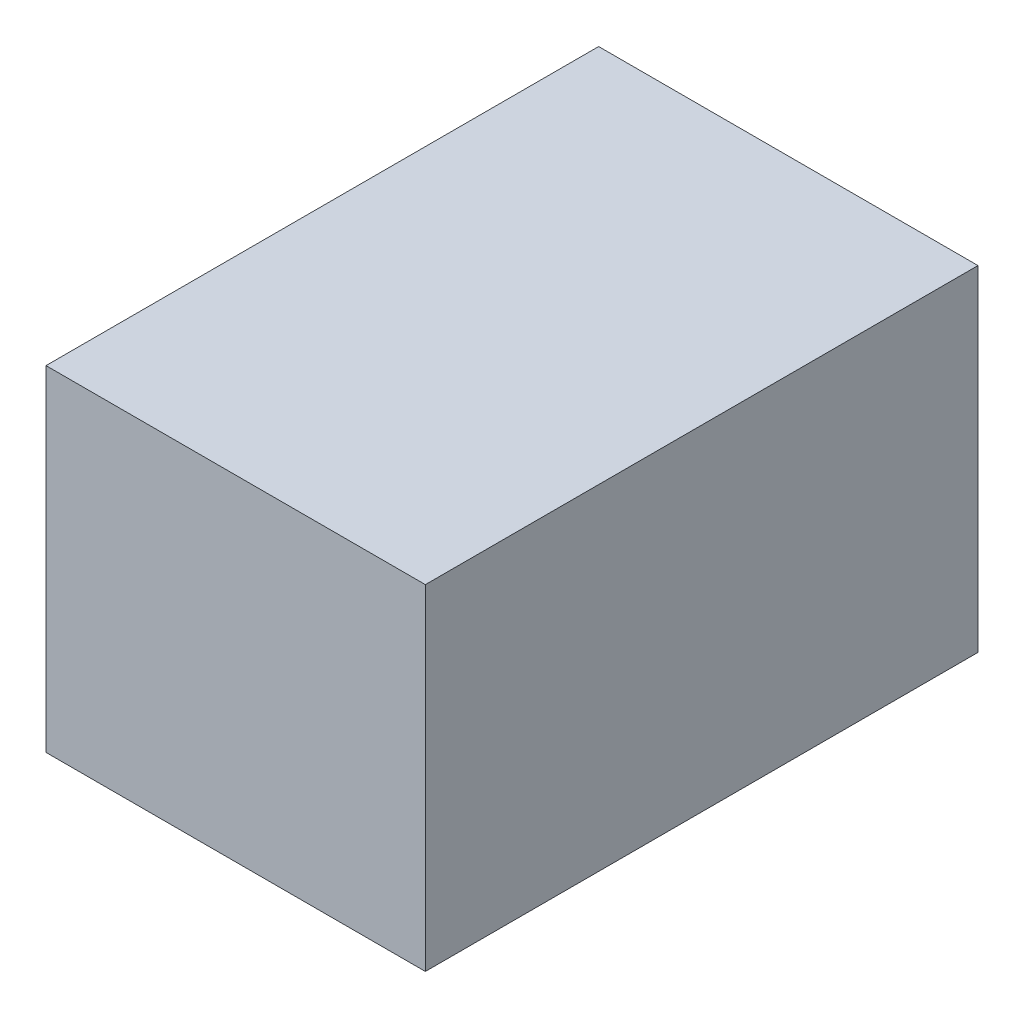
ISO-10303-21;
HEADER;
FILE_DESCRIPTION(('STEP AP214'),'2;1');
FILE_NAME('part.step','',(''),(''),'','','');
FILE_SCHEMA(('AUTOMOTIVE_DESIGN { 1 0 10303 214 1 1 1 1 }'));
ENDSEC;
DATA;
#1=APPLICATION_CONTEXT('core data for automotive mechanical design processes');
#2=APPLICATION_PROTOCOL_DEFINITION('international standard','automotive_design',2000,#1);
#3=PRODUCT_CONTEXT('',#1,'mechanical');
#4=PRODUCT('Part','Part','',(#3));
#5=PRODUCT_RELATED_PRODUCT_CATEGORY('part','',(#4));
#6=PRODUCT_DEFINITION_FORMATION('','',#4);
#7=PRODUCT_DEFINITION_CONTEXT('part definition',#1,'design');
#8=PRODUCT_DEFINITION('design','',#6,#7);
#9=PRODUCT_DEFINITION_SHAPE('','',#8);
#10=(LENGTH_UNIT() NAMED_UNIT(*) SI_UNIT(.MILLI.,.METRE.));
#11=(NAMED_UNIT(*) PLANE_ANGLE_UNIT() SI_UNIT($,.RADIAN.));
#12=(NAMED_UNIT(*) SI_UNIT($,.STERADIAN.) SOLID_ANGLE_UNIT());
#13=UNCERTAINTY_MEASURE_WITH_UNIT(LENGTH_MEASURE(1.E-05),#10,'distance_accuracy_value','');
#14=(GEOMETRIC_REPRESENTATION_CONTEXT(3) GLOBAL_UNCERTAINTY_ASSIGNED_CONTEXT((#13)) GLOBAL_UNIT_ASSIGNED_CONTEXT((#10,
#11,#12)) REPRESENTATION_CONTEXT('',''));
#15=CARTESIAN_POINT('',(0.,0.,0.));
#16=DIRECTION('',(0.,0.,1.));
#17=DIRECTION('',(1.,0.,0.));
#18=AXIS2_PLACEMENT_3D('',#15,#16,#17);
#19=CARTESIAN_POINT('',(102.966766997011,90.934066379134,300.));
#20=DIRECTION('',(-1.,0.,0.));
#21=DIRECTION('',(0.,0.,1.));
#22=AXIS2_PLACEMENT_3D('',#19,#20,#21);
#23=PLANE('',#22);
#24=DIRECTION('',(0.,1.,0.));
#25=VECTOR('',#24,1.);
#26=CARTESIAN_POINT('',(102.966766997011,90.934066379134,0.));
#27=LINE('',#26,#25);
#28=CARTESIAN_POINT('',(102.966766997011,-90.934066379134,0.));
#29=VERTEX_POINT('',#28);
#30=CARTESIAN_POINT('',(102.966766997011,90.934066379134,0.));
#31=VERTEX_POINT('',#30);
#32=EDGE_CURVE('E96',#29,#31,#27,.T.);
#33=ORIENTED_EDGE('',*,*,#32,.T.);
#34=DIRECTION('',(0.,0.,-1.));
#35=VECTOR('',#34,1.);
#36=CARTESIAN_POINT('',(102.966766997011,90.934066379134,300.));
#37=LINE('',#36,#35);
#38=CARTESIAN_POINT('',(102.966766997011,90.934066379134,300.));
#39=VERTEX_POINT('',#38);
#40=EDGE_CURVE('E11',#39,#31,#37,.T.);
#41=ORIENTED_EDGE('',*,*,#40,.F.);
#42=DIRECTION('',(0.,1.,0.));
#43=VECTOR('',#42,1.);
#44=CARTESIAN_POINT('',(102.966766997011,90.934066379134,300.));
#45=LINE('',#44,#43);
#46=CARTESIAN_POINT('',(102.966766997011,-90.934066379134,300.));
#47=VERTEX_POINT('',#46);
#48=EDGE_CURVE('E84',#47,#39,#45,.T.);
#49=ORIENTED_EDGE('',*,*,#48,.F.);
#50=DIRECTION('',(0.,0.,-1.));
#51=VECTOR('',#50,1.);
#52=CARTESIAN_POINT('',(102.966766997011,-90.934066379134,300.));
#53=LINE('',#52,#51);
#54=EDGE_CURVE('E92',#47,#29,#53,.T.);
#55=ORIENTED_EDGE('',*,*,#54,.T.);
#56=EDGE_LOOP('',(#33,#41,#49,#55));
#57=FACE_BOUND('',#56,.T.);
#58=ADVANCED_FACE('F33',(#57),#23,.F.);
#59=CARTESIAN_POINT('',(-102.966766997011,90.934066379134,300.));
#60=DIRECTION('',(0.,-1.,0.));
#61=DIRECTION('',(0.,0.,-1.));
#62=AXIS2_PLACEMENT_3D('',#59,#60,#61);
#63=PLANE('',#62);
#64=DIRECTION('',(-1.,0.,0.));
#65=VECTOR('',#64,1.);
#66=CARTESIAN_POINT('',(-102.966766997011,90.934066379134,0.));
#67=LINE('',#66,#65);
#68=CARTESIAN_POINT('',(-102.966766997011,90.934066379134,0.));
#69=VERTEX_POINT('',#68);
#70=EDGE_CURVE('E88',#31,#69,#67,.T.);
#71=ORIENTED_EDGE('',*,*,#70,.T.);
#72=DIRECTION('',(0.,0.,-1.));
#73=VECTOR('',#72,1.);
#74=CARTESIAN_POINT('',(-102.966766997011,90.934066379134,300.));
#75=LINE('',#74,#73);
#76=CARTESIAN_POINT('',(-102.966766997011,90.934066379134,300.));
#77=VERTEX_POINT('',#76);
#78=EDGE_CURVE('E41',#77,#69,#75,.T.);
#79=ORIENTED_EDGE('',*,*,#78,.F.);
#80=DIRECTION('',(-1.,0.,0.));
#81=VECTOR('',#80,1.);
#82=CARTESIAN_POINT('',(-102.966766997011,90.934066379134,300.));
#83=LINE('',#82,#81);
#84=EDGE_CURVE('E79',#39,#77,#83,.T.);
#85=ORIENTED_EDGE('',*,*,#84,.F.);
#86=ORIENTED_EDGE('',*,*,#40,.T.);
#87=EDGE_LOOP('',(#71,#79,#85,#86));
#88=FACE_BOUND('',#87,.T.);
#89=ADVANCED_FACE('F87',(#88),#63,.F.);
#90=CARTESIAN_POINT('',(-102.966766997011,90.934066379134,300.));
#91=DIRECTION('',(1.,0.,0.));
#92=DIRECTION('',(0.,0.,-1.));
#93=AXIS2_PLACEMENT_3D('',#90,#91,#92);
#94=PLANE('',#93);
#95=DIRECTION('',(0.,-1.,0.));
#96=VECTOR('',#95,1.);
#97=CARTESIAN_POINT('',(-102.966766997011,90.934066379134,0.));
#98=LINE('',#97,#96);
#99=CARTESIAN_POINT('',(-102.966766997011,-90.934066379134,0.));
#100=VERTEX_POINT('',#99);
#101=EDGE_CURVE('E66',#69,#100,#98,.T.);
#102=ORIENTED_EDGE('',*,*,#101,.T.);
#103=DIRECTION('',(0.,0.,-1.));
#104=VECTOR('',#103,1.);
#105=CARTESIAN_POINT('',(-102.966766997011,-90.934066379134,300.));
#106=LINE('',#105,#104);
#107=CARTESIAN_POINT('',(-102.966766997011,-90.934066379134,300.));
#108=VERTEX_POINT('',#107);
#109=EDGE_CURVE('E89',#108,#100,#106,.T.);
#110=ORIENTED_EDGE('',*,*,#109,.F.);
#111=DIRECTION('',(0.,-1.,0.));
#112=VECTOR('',#111,1.);
#113=CARTESIAN_POINT('',(-102.966766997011,90.934066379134,300.));
#114=LINE('',#113,#112);
#115=EDGE_CURVE('E82',#77,#108,#114,.T.);
#116=ORIENTED_EDGE('',*,*,#115,.F.);
#117=ORIENTED_EDGE('',*,*,#78,.T.);
#118=EDGE_LOOP('',(#102,#110,#116,#117));
#119=FACE_BOUND('',#118,.T.);
#120=ADVANCED_FACE('F90',(#119),#94,.F.);
#121=CARTESIAN_POINT('',(-102.966766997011,-90.934066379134,300.));
#122=DIRECTION('',(0.,1.,0.));
#123=DIRECTION('',(-1.,0.,0.));
#124=AXIS2_PLACEMENT_3D('',#121,#122,#123);
#125=PLANE('',#124);
#126=DIRECTION('',(1.,0.,0.));
#127=VECTOR('',#126,1.);
#128=CARTESIAN_POINT('',(-102.966766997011,-90.934066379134,0.));
#129=LINE('',#128,#127);
#130=EDGE_CURVE('E72',#100,#29,#129,.T.);
#131=ORIENTED_EDGE('',*,*,#130,.T.);
#132=ORIENTED_EDGE('',*,*,#54,.F.);
#133=DIRECTION('',(1.,0.,0.));
#134=VECTOR('',#133,1.);
#135=CARTESIAN_POINT('',(-102.966766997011,-90.934066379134,300.));
#136=LINE('',#135,#134);
#137=EDGE_CURVE('E49',#108,#47,#136,.T.);
#138=ORIENTED_EDGE('',*,*,#137,.F.);
#139=ORIENTED_EDGE('',*,*,#109,.T.);
#140=EDGE_LOOP('',(#131,#132,#138,#139));
#141=FACE_BOUND('',#140,.T.);
#142=ADVANCED_FACE('F104',(#141),#125,.F.);
#143=CARTESIAN_POINT('',(0.,0.,300.));
#144=DIRECTION('',(0.,0.,1.));
#145=DIRECTION('',(1.,0.,0.));
#146=AXIS2_PLACEMENT_3D('',#143,#144,#145);
#147=PLANE('',#146);
#148=ORIENTED_EDGE('',*,*,#48,.T.);
#149=ORIENTED_EDGE('',*,*,#84,.T.);
#150=ORIENTED_EDGE('',*,*,#115,.T.);
#151=ORIENTED_EDGE('',*,*,#137,.T.);
#152=EDGE_LOOP('',(#148,#149,#150,#151));
#153=FACE_BOUND('',#152,.T.);
#154=ADVANCED_FACE('F80',(#153),#147,.T.);
#155=CARTESIAN_POINT('',(0.,0.,0.));
#156=DIRECTION('',(0.,0.,1.));
#157=DIRECTION('',(1.,0.,0.));
#158=AXIS2_PLACEMENT_3D('',#155,#156,#157);
#159=PLANE('',#158);
#160=ORIENTED_EDGE('',*,*,#32,.F.);
#161=ORIENTED_EDGE('',*,*,#130,.F.);
#162=ORIENTED_EDGE('',*,*,#101,.F.);
#163=ORIENTED_EDGE('',*,*,#70,.F.);
#164=EDGE_LOOP('',(#160,#161,#162,#163));
#165=FACE_BOUND('',#164,.T.);
#166=ADVANCED_FACE('F107',(#165),#159,.F.);
#167=CLOSED_SHELL('',(#58,#89,#120,#142,#154,#166));
#168=CARTESIAN_POINT('',(0.,0.,235.8976));
#169=DIRECTION('',(0.,0.,1.));
#170=DIRECTION('',(1.,0.,0.));
#171=AXIS2_PLACEMENT_3D('',#168,#169,#170);
#172=PLANE('',#171);
#173=CARTESIAN_POINT('',(0.,0.,235.8976));
#174=DIRECTION('',(0.,0.,1.));
#175=DIRECTION('',(1.,0.,0.));
#176=AXIS2_PLACEMENT_3D('',#173,#174,#175);
#177=CIRCLE('',#176,30.9366);
#178=CARTESIAN_POINT('',(30.9366,0.,235.8976));
#179=VERTEX_POINT('',#178);
#180=EDGE_CURVE('E99',#179,#179,#177,.T.);
#181=ORIENTED_EDGE('',*,*,#180,.F.);
#182=EDGE_LOOP('',(#181));
#183=FACE_BOUND('',#182,.T.);
#184=ADVANCED_FACE('F175',(#183),#172,.F.);
#185=CARTESIAN_POINT('',(0.,0.,235.8976));
#186=DIRECTION('',(0.,0.,1.));
#187=DIRECTION('',(1.,0.,0.));
#188=AXIS2_PLACEMENT_3D('',#185,#186,#187);
#189=CYLINDRICAL_SURFACE('',#188,30.9366);
#190=CARTESIAN_POINT('',(0.,0.,223.433118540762));
#191=DIRECTION('',(0.,0.,1.));
#192=DIRECTION('',(1.,0.,0.));
#193=AXIS2_PLACEMENT_3D('',#190,#191,#192);
#194=CIRCLE('',#193,30.9366);
#195=CARTESIAN_POINT('',(30.9366,0.,223.433118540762));
#196=VERTEX_POINT('',#195);
#197=EDGE_CURVE('E112',#196,#196,#194,.T.);
#198=ORIENTED_EDGE('',*,*,#197,.F.);
#199=EDGE_LOOP('',(#198));
#200=FACE_BOUND('',#199,.T.);
#201=ORIENTED_EDGE('',*,*,#180,.T.);
#202=EDGE_LOOP('',(#201));
#203=FACE_BOUND('',#202,.T.);
#204=ADVANCED_FACE('F178',(#200,#203),#189,.F.);
#205=CARTESIAN_POINT('',(0.,0.,223.433118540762));
#206=DIRECTION('',(0.,0.,1.));
#207=DIRECTION('',(1.,0.,0.));
#208=AXIS2_PLACEMENT_3D('',#205,#206,#207);
#209=TOROIDAL_SURFACE('',#208,41.2488,10.3122);
#210=ORIENTED_EDGE('',*,*,#197,.T.);
#211=EDGE_LOOP('',(#210));
#212=FACE_BOUND('',#211,.T.);
#213=CARTESIAN_POINT('',(0.,0.,213.981831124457));
#214=DIRECTION('',(0.,0.,1.));
#215=DIRECTION('',(1.,0.,0.));
#216=AXIS2_PLACEMENT_3D('',#213,#214,#215);
#217=CIRCLE('',#216,37.12392);
#218=CARTESIAN_POINT('',(37.12392,0.,213.981831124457));
#219=VERTEX_POINT('',#218);
#220=EDGE_CURVE('E115',#219,#219,#217,.T.);
#221=ORIENTED_EDGE('',*,*,#220,.F.);
#222=EDGE_LOOP('',(#221));
#223=FACE_BOUND('',#222,.T.);
#224=ADVANCED_FACE('F185',(#212,#223),#209,.T.);
#225=CARTESIAN_POINT('',(0.,0.,199.8049));
#226=DIRECTION('',(0.,0.,1.));
#227=DIRECTION('',(1.,0.,0.));
#228=AXIS2_PLACEMENT_3D('',#225,#226,#227);
#229=TOROIDAL_SURFACE('',#228,30.9366,15.4683);
#230=CARTESIAN_POINT('',(0.,0.,184.3366));
#231=DIRECTION('',(0.,0.,1.));
#232=DIRECTION('',(1.,0.,0.));
#233=AXIS2_PLACEMENT_3D('',#230,#231,#232);
#234=CIRCLE('',#233,30.9366);
#235=CARTESIAN_POINT('',(30.9366,0.,184.3366));
#236=VERTEX_POINT('',#235);
#237=EDGE_CURVE('E118',#236,#236,#234,.T.);
#238=ORIENTED_EDGE('',*,*,#237,.F.);
#239=EDGE_LOOP('',(#238));
#240=FACE_BOUND('',#239,.T.);
#241=ORIENTED_EDGE('',*,*,#220,.T.);
#242=EDGE_LOOP('',(#241));
#243=FACE_BOUND('',#242,.T.);
#244=ADVANCED_FACE('F250',(#240,#243),#229,.F.);
#245=CARTESIAN_POINT('',(0.,0.,174.0244));
#246=DIRECTION('',(0.,0.,1.));
#247=DIRECTION('',(1.,0.,0.));
#248=AXIS2_PLACEMENT_3D('',#245,#246,#247);
#249=TOROIDAL_SURFACE('',#248,30.9366,10.3122);
#250=ORIENTED_EDGE('',*,*,#237,.T.);
#251=EDGE_LOOP('',(#250));
#252=FACE_BOUND('',#251,.T.);
#253=CARTESIAN_POINT('',(0.,0.,174.0244));
#254=DIRECTION('',(0.,0.,1.));
#255=DIRECTION('',(1.,0.,0.));
#256=AXIS2_PLACEMENT_3D('',#253,#254,#255);
#257=CIRCLE('',#256,20.6244);
#258=CARTESIAN_POINT('',(20.6244,0.,174.0244));
#259=VERTEX_POINT('',#258);
#260=EDGE_CURVE('E121',#259,#259,#257,.T.);
#261=ORIENTED_EDGE('',*,*,#260,.F.);
#262=EDGE_LOOP('',(#261));
#263=FACE_BOUND('',#262,.T.);
#264=ADVANCED_FACE('F259',(#252,#263),#249,.T.);
#265=CARTESIAN_POINT('',(0.,0.,235.8976));
#266=DIRECTION('',(0.,0.,1.));
#267=DIRECTION('',(1.,0.,0.));
#268=AXIS2_PLACEMENT_3D('',#265,#266,#267);
#269=CYLINDRICAL_SURFACE('',#268,20.6244);
#270=CARTESIAN_POINT('',(0.,0.,158.5561));
#271=DIRECTION('',(0.,0.,1.));
#272=DIRECTION('',(1.,0.,0.));
#273=AXIS2_PLACEMENT_3D('',#270,#271,#272);
#274=CIRCLE('',#273,20.6244);
#275=CARTESIAN_POINT('',(20.6244,0.,158.5561));
#276=VERTEX_POINT('',#275);
#277=EDGE_CURVE('E124',#276,#276,#274,.T.);
#278=ORIENTED_EDGE('',*,*,#277,.F.);
#279=EDGE_LOOP('',(#278));
#280=FACE_BOUND('',#279,.T.);
#281=ORIENTED_EDGE('',*,*,#260,.T.);
#282=EDGE_LOOP('',(#281));
#283=FACE_BOUND('',#282,.T.);
#284=ADVANCED_FACE('F269',(#280,#283),#269,.F.);
#285=CARTESIAN_POINT('',(0.,0.,158.5561));
#286=DIRECTION('',(0.,0.,1.));
#287=DIRECTION('',(1.,0.,0.));
#288=AXIS2_PLACEMENT_3D('',#285,#286,#287);
#289=TOROIDAL_SURFACE('',#288,25.7805,5.1561);
#290=ORIENTED_EDGE('',*,*,#277,.T.);
#291=EDGE_LOOP('',(#290));
#292=FACE_BOUND('',#291,.T.);
#293=CARTESIAN_POINT('',(0.,0.,153.4));
#294=DIRECTION('',(0.,0.,1.));
#295=DIRECTION('',(1.,0.,0.));
#296=AXIS2_PLACEMENT_3D('',#293,#294,#295);
#297=CIRCLE('',#296,25.7805);
#298=CARTESIAN_POINT('',(25.7805,0.,153.4));
#299=VERTEX_POINT('',#298);
#300=EDGE_CURVE('E127',#299,#299,#297,.T.);
#301=ORIENTED_EDGE('',*,*,#300,.F.);
#302=EDGE_LOOP('',(#301));
#303=FACE_BOUND('',#302,.T.);
#304=ADVANCED_FACE('F279',(#292,#303),#289,.T.);
#305=CARTESIAN_POINT('',(0.,0.,153.4));
#306=DIRECTION('',(0.,0.,1.));
#307=DIRECTION('',(1.,0.,0.));
#308=AXIS2_PLACEMENT_3D('',#305,#306,#307);
#309=PLANE('',#308);
#310=CARTESIAN_POINT('',(0.,0.,153.4));
#311=DIRECTION('',(0.,0.,1.));
#312=DIRECTION('',(1.,0.,0.));
#313=AXIS2_PLACEMENT_3D('',#310,#311,#312);
#314=CIRCLE('',#313,28.35855);
#315=CARTESIAN_POINT('',(28.35855,0.,153.4));
#316=VERTEX_POINT('',#315);
#317=EDGE_CURVE('E130',#316,#316,#314,.T.);
#318=ORIENTED_EDGE('',*,*,#317,.F.);
#319=EDGE_LOOP('',(#318));
#320=FACE_BOUND('',#319,.T.);
#321=ORIENTED_EDGE('',*,*,#300,.T.);
#322=EDGE_LOOP('',(#321));
#323=FACE_BOUND('',#322,.T.);
#324=ADVANCED_FACE('F289',(#320,#323),#309,.F.);
#325=CARTESIAN_POINT('',(0.,0.,150.82195));
#326=DIRECTION('',(0.,0.,1.));
#327=DIRECTION('',(1.,0.,0.));
#328=AXIS2_PLACEMENT_3D('',#325,#326,#327);
#329=TOROIDAL_SURFACE('',#328,28.35855,2.57805);
#330=CARTESIAN_POINT('',(0.,0.,150.82195));
#331=DIRECTION('',(0.,0.,1.));
#332=DIRECTION('',(1.,0.,0.));
#333=AXIS2_PLACEMENT_3D('',#330,#331,#332);
#334=CIRCLE('',#333,30.9366);
#335=CARTESIAN_POINT('',(30.9366,0.,150.82195));
#336=VERTEX_POINT('',#335);
#337=EDGE_CURVE('E133',#336,#336,#334,.T.);
#338=ORIENTED_EDGE('',*,*,#337,.F.);
#339=EDGE_LOOP('',(#338));
#340=FACE_BOUND('',#339,.T.);
#341=ORIENTED_EDGE('',*,*,#317,.T.);
#342=EDGE_LOOP('',(#341));
#343=FACE_BOUND('',#342,.T.);
#344=ADVANCED_FACE('F172',(#340,#343),#329,.F.);
#345=CARTESIAN_POINT('',(0.,0.,235.8976));
#346=DIRECTION('',(0.,0.,1.));
#347=DIRECTION('',(1.,0.,0.));
#348=AXIS2_PLACEMENT_3D('',#345,#346,#347);
#349=CYLINDRICAL_SURFACE('',#348,30.9366);
#350=CARTESIAN_POINT('',(0.,0.,114.72925));
#351=DIRECTION('',(0.,0.,1.));
#352=DIRECTION('',(1.,0.,0.));
#353=AXIS2_PLACEMENT_3D('',#350,#351,#352);
#354=CIRCLE('',#353,30.9366);
#355=CARTESIAN_POINT('',(30.9366,0.,114.72925));
#356=VERTEX_POINT('',#355);
#357=EDGE_CURVE('E136',#356,#356,#354,.T.);
#358=ORIENTED_EDGE('',*,*,#357,.F.);
#359=EDGE_LOOP('',(#358));
#360=FACE_BOUND('',#359,.T.);
#361=ORIENTED_EDGE('',*,*,#337,.T.);
#362=EDGE_LOOP('',(#361));
#363=FACE_BOUND('',#362,.T.);
#364=ADVANCED_FACE('F166',(#360,#363),#349,.F.);
#365=CARTESIAN_POINT('',(0.,0.,114.72925));
#366=DIRECTION('',(0.,0.,1.));
#367=DIRECTION('',(1.,0.,0.));
#368=AXIS2_PLACEMENT_3D('',#365,#366,#367);
#369=TOROIDAL_SURFACE('',#368,33.51465,2.57805);
#370=ORIENTED_EDGE('',*,*,#357,.T.);
#371=EDGE_LOOP('',(#370));
#372=FACE_BOUND('',#371,.T.);
#373=CARTESIAN_POINT('',(0.,0.,112.1512));
#374=DIRECTION('',(0.,0.,1.));
#375=DIRECTION('',(1.,0.,0.));
#376=AXIS2_PLACEMENT_3D('',#373,#374,#375);
#377=CIRCLE('',#376,33.51465);
#378=CARTESIAN_POINT('',(33.51465,0.,112.1512));
#379=VERTEX_POINT('',#378);
#380=EDGE_CURVE('E139',#379,#379,#377,.T.);
#381=ORIENTED_EDGE('',*,*,#380,.F.);
#382=EDGE_LOOP('',(#381));
#383=FACE_BOUND('',#382,.T.);
#384=ADVANCED_FACE('F161',(#372,#383),#369,.T.);
#385=CARTESIAN_POINT('',(0.,0.,112.1512));
#386=DIRECTION('',(0.,0.,1.));
#387=DIRECTION('',(1.,0.,0.));
#388=AXIS2_PLACEMENT_3D('',#385,#386,#387);
#389=PLANE('',#388);
#390=CARTESIAN_POINT('',(0.,0.,112.1512));
#391=DIRECTION('',(0.,0.,1.));
#392=DIRECTION('',(1.,0.,0.));
#393=AXIS2_PLACEMENT_3D('',#390,#391,#392);
#394=CIRCLE('',#393,41.2488);
#395=CARTESIAN_POINT('',(41.2488,0.,112.1512));
#396=VERTEX_POINT('',#395);
#397=EDGE_CURVE('E142',#396,#396,#394,.T.);
#398=ORIENTED_EDGE('',*,*,#397,.F.);
#399=EDGE_LOOP('',(#398));
#400=FACE_BOUND('',#399,.T.);
#401=ORIENTED_EDGE('',*,*,#380,.T.);
#402=EDGE_LOOP('',(#401));
#403=FACE_BOUND('',#402,.T.);
#404=ADVANCED_FACE('F154',(#400,#403),#389,.F.);
#405=CARTESIAN_POINT('',(0.,0.,91.5268000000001));
#406=DIRECTION('',(0.,0.,1.));
#407=DIRECTION('',(1.,0.,0.));
#408=AXIS2_PLACEMENT_3D('',#405,#406,#407);
#409=TOROIDAL_SURFACE('',#408,41.2488,20.6244);
#410=CARTESIAN_POINT('',(0.,0.,70.9024000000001));
#411=DIRECTION('',(0.,0.,1.));
#412=DIRECTION('',(1.,0.,0.));
#413=AXIS2_PLACEMENT_3D('',#410,#411,#412);
#414=CIRCLE('',#413,41.2488);
#415=CARTESIAN_POINT('',(41.2488,0.,70.9024000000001));
#416=VERTEX_POINT('',#415);
#417=EDGE_CURVE('E145',#416,#416,#414,.T.);
#418=ORIENTED_EDGE('',*,*,#417,.F.);
#419=EDGE_LOOP('',(#418));
#420=FACE_BOUND('',#419,.T.);
#421=ORIENTED_EDGE('',*,*,#397,.T.);
#422=EDGE_LOOP('',(#421));
#423=FACE_BOUND('',#422,.T.);
#424=ADVANCED_FACE('F151',(#420,#423),#409,.F.);
#425=CARTESIAN_POINT('',(0.,0.,70.9024000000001));
#426=DIRECTION('',(0.,0.,-1.));
#427=DIRECTION('',(-1.,0.,0.));
#428=AXIS2_PLACEMENT_3D('',#425,#426,#427);
#429=PLANE('',#428);
#430=ORIENTED_EDGE('',*,*,#417,.T.);
#431=EDGE_LOOP('',(#430));
#432=FACE_BOUND('',#431,.T.);
#433=ADVANCED_FACE('F149',(#432),#429,.F.);
#434=CLOSED_SHELL('',(#184,#204,#224,#244,#264,#284,#304,#324,#344,#364,#384,#404,#424,#433));
#435=ORIENTED_CLOSED_SHELL('',*,#434,.T.);
#436=BREP_WITH_VOIDS('B2',#167,(#435));
#437=ADVANCED_BREP_SHAPE_REPRESENTATION('',(#18,#436),#14);
#438=SHAPE_DEFINITION_REPRESENTATION(#9,#437);
ENDSEC;
END-ISO-10303-21;
